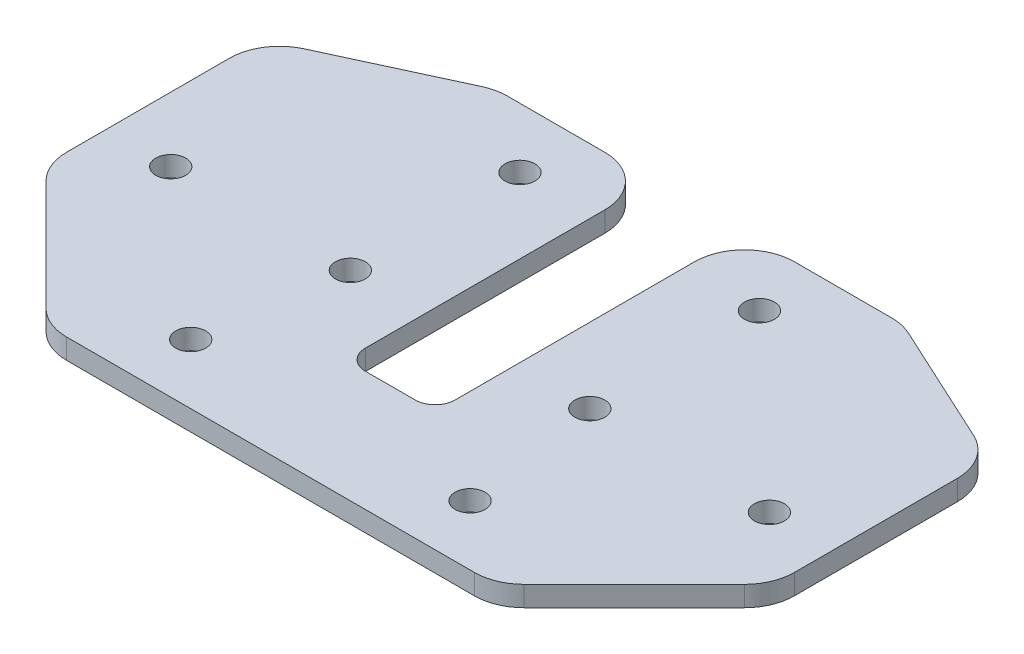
from build123d import *

# Parameters (mm, degrees)
SKETCH1_R           = 1.5
BOSS_EXTRUDE1_DEPTH = 2.032
FILLET1_R           = 5
FILLET2_R           = 2


with BuildPart() as part:
    # Sketch1 → Boss-Extrude1 (new body)
    with BuildSketch(Plane(origin=(0, 0, 0), x_dir=(1, 0, 0), z_dir=(0, 1, 0))):
        Polygon((32.139024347, -17.859509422), (14.139024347, -17.859509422), (0.169024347, -3.889509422), (0.169024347, 10.080490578), (0.169024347, 17.700490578), (16.264024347, 25.140490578), (32.139024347, 25.140490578), (32.139024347, -5.859509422), (36.639024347, -5.859509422), (36.639024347, -17.859509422), align=None)
        with Locations(Location((24.639024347, 19.140490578, 0), (0, 0, 270))):
            Circle(SKETCH1_R, mode=Mode.SUBTRACT)
        with Locations(Location((24.639024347, 2.140490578, 0), (0, 0, 270))):
            Circle(SKETCH1_R, mode=Mode.SUBTRACT)
        with Locations(Location((22.639024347, -11.859509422, 0), (0, 0, 270))):
            Circle(SKETCH1_R, mode=Mode.SUBTRACT)
        with Locations(Location((6.639024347, 2.140490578, 0), (0, 0, 270))):
            Circle(SKETCH1_R, mode=Mode.SUBTRACT)
    boss_extrude1 = extrude(amount=BOSS_EXTRUDE1_DEPTH)

    # Mirror1: Boss-Extrude1 across plane
    add(boss_extrude1.mirror(Plane(origin=(36.639024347, 2.032, 17.859509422), x_dir=(0, 0, 1), z_dir=(-1, 0, 0))))

    # Fillet1
    fillet1_edges = [part.edges().sort_by_distance(p)[0] for p in [
        (14.139024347, 1.016, 17.859509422),
        (0.169024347, 1.016, 3.889509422),
        (0.169024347, 1.016, -17.700490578),
        (16.264024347, 1.016, -25.140490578),
        (32.139024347, 1.016, -25.140490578),
        (59.139024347, 1.016, 17.859509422),
        (73.109024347, 1.016, 3.889509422),
        (73.109024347, 1.016, -17.700490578),
        (57.014024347, 1.016, -25.140490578),
        (41.139024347, 1.016, -25.140490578),
    ]]
    fillet(fillet1_edges, radius=FILLET1_R)

    # Fillet2
    fillet2_edges = [part.edges().sort_by_distance(p)[0] for p in [
        (32.139024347, 1.016, 5.859509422),
        (41.139024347, 1.016, 5.859509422),
    ]]
    fillet(fillet2_edges, radius=FILLET2_R)


solid = part.part
